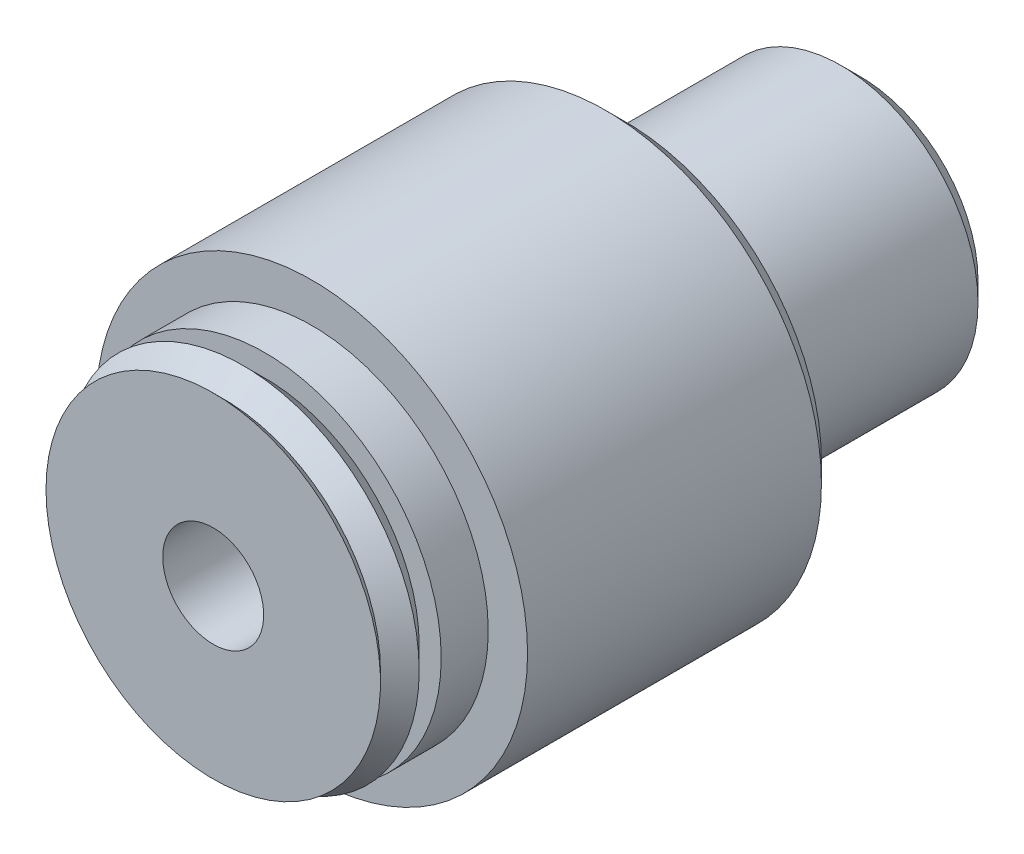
ISO-10303-21;
HEADER;
FILE_DESCRIPTION(('STEP AP214'),'2;1');
FILE_NAME('part.step','',(''),(''),'','','');
FILE_SCHEMA(('AUTOMOTIVE_DESIGN { 1 0 10303 214 1 1 1 1 }'));
ENDSEC;
DATA;
#1=APPLICATION_CONTEXT('core data for automotive mechanical design processes');
#2=APPLICATION_PROTOCOL_DEFINITION('international standard','automotive_design',2000,#1);
#3=PRODUCT_CONTEXT('',#1,'mechanical');
#4=PRODUCT('Part','Part','',(#3));
#5=PRODUCT_RELATED_PRODUCT_CATEGORY('part','',(#4));
#6=PRODUCT_DEFINITION_FORMATION('','',#4);
#7=PRODUCT_DEFINITION_CONTEXT('part definition',#1,'design');
#8=PRODUCT_DEFINITION('design','',#6,#7);
#9=PRODUCT_DEFINITION_SHAPE('','',#8);
#10=(LENGTH_UNIT() NAMED_UNIT(*) SI_UNIT(.MILLI.,.METRE.));
#11=(NAMED_UNIT(*) PLANE_ANGLE_UNIT() SI_UNIT($,.RADIAN.));
#12=(NAMED_UNIT(*) SI_UNIT($,.STERADIAN.) SOLID_ANGLE_UNIT());
#13=UNCERTAINTY_MEASURE_WITH_UNIT(LENGTH_MEASURE(1.E-05),#10,'distance_accuracy_value','');
#14=(GEOMETRIC_REPRESENTATION_CONTEXT(3) GLOBAL_UNCERTAINTY_ASSIGNED_CONTEXT((#13)) GLOBAL_UNIT_ASSIGNED_CONTEXT((#10,
#11,#12)) REPRESENTATION_CONTEXT('',''));
#15=CARTESIAN_POINT('',(0.,0.,0.));
#16=DIRECTION('',(0.,0.,1.));
#17=DIRECTION('',(1.,0.,0.));
#18=AXIS2_PLACEMENT_3D('',#15,#16,#17);
#19=CARTESIAN_POINT('',(0.,0.,0.));
#20=DIRECTION('',(0.,0.,1.));
#21=DIRECTION('',(1.,0.,0.));
#22=AXIS2_PLACEMENT_3D('',#19,#20,#21);
#23=PLANE('',#22);
#24=CARTESIAN_POINT('',(0.,0.,0.));
#25=DIRECTION('',(0.,0.,-1.));
#26=DIRECTION('',(-1.,0.,0.));
#27=AXIS2_PLACEMENT_3D('',#24,#25,#26);
#28=CIRCLE('',#27,6.77545);
#29=CARTESIAN_POINT('',(-6.77545000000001,0.,0.));
#30=VERTEX_POINT('',#29);
#31=EDGE_CURVE('E117',#30,#30,#28,.T.);
#32=ORIENTED_EDGE('',*,*,#31,.F.);
#33=EDGE_LOOP('',(#32));
#34=FACE_BOUND('',#33,.T.);
#35=CARTESIAN_POINT('',(0.,0.,0.));
#36=DIRECTION('',(0.,0.,-1.));
#37=DIRECTION('',(-1.,0.,0.));
#38=AXIS2_PLACEMENT_3D('',#35,#36,#37);
#39=CIRCLE('',#38,2.0447);
#40=CARTESIAN_POINT('',(-2.0447,0.,0.));
#41=VERTEX_POINT('',#40);
#42=EDGE_CURVE('E128',#41,#41,#39,.T.);
#43=ORIENTED_EDGE('',*,*,#42,.T.);
#44=EDGE_LOOP('',(#43));
#45=FACE_BOUND('',#44,.T.);
#46=ADVANCED_FACE('F32',(#34,#45),#23,.T.);
#47=CARTESIAN_POINT('',(0.,0.,-26.223214));
#48=DIRECTION('',(0.,0.,-1.));
#49=DIRECTION('',(-1.,0.,0.));
#50=AXIS2_PLACEMENT_3D('',#47,#48,#49);
#51=PLANE('',#50);
#52=CARTESIAN_POINT('',(0.,0.,-26.223214));
#53=DIRECTION('',(0.,0.,-1.));
#54=DIRECTION('',(-1.,0.,0.));
#55=AXIS2_PLACEMENT_3D('',#52,#53,#54);
#56=CIRCLE('',#55,4.7625);
#57=CARTESIAN_POINT('',(4.76250000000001,0.,-26.223214));
#58=VERTEX_POINT('',#57);
#59=EDGE_CURVE('E49',#58,#58,#56,.T.);
#60=ORIENTED_EDGE('',*,*,#59,.T.);
#61=EDGE_LOOP('',(#60));
#62=FACE_BOUND('',#61,.T.);
#63=CARTESIAN_POINT('',(0.,0.,-26.223214));
#64=DIRECTION('',(0.,0.,-1.));
#65=DIRECTION('',(-1.,0.,0.));
#66=AXIS2_PLACEMENT_3D('',#63,#64,#65);
#67=CIRCLE('',#66,2.0447);
#68=CARTESIAN_POINT('',(-2.0447,0.,-26.223214));
#69=VERTEX_POINT('',#68);
#70=EDGE_CURVE('E126',#69,#69,#67,.T.);
#71=ORIENTED_EDGE('',*,*,#70,.F.);
#72=EDGE_LOOP('',(#71));
#73=FACE_BOUND('',#72,.T.);
#74=ADVANCED_FACE('F65',(#62,#73),#51,.T.);
#75=CARTESIAN_POINT('',(-8.73760000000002,0.,-7.173214));
#76=DIRECTION('',(1.,0.,0.));
#77=DIRECTION('',(0.,0.,-1.));
#78=AXIS2_PLACEMENT_3D('',#75,#76,#77);
#79=CYLINDRICAL_SURFACE('',#78,2.032);
#80=CARTESIAN_POINT('',(-8.73760000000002,0.,-9.205214));
#81=CARTESIAN_POINT('',(-8.73759797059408,-0.112516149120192,-9.20521042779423));
#82=CARTESIAN_POINT('',(-8.73540475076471,-0.225074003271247,-9.1958371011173));
#83=CARTESIAN_POINT('',(-8.72686767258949,-0.44698022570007,-9.15863769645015));
#84=CARTESIAN_POINT('',(-8.72052111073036,-0.556326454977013,-9.13079959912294));
#85=CARTESIAN_POINT('',(-8.70438234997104,-0.768571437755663,-9.05759945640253));
#86=CARTESIAN_POINT('',(-8.6945939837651,-0.871477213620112,-9.0122568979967));
#87=CARTESIAN_POINT('',(-8.67262205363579,-1.06821919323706,-8.90539972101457));
#88=CARTESIAN_POINT('',(-8.6604384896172,-1.16205539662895,-8.84388510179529));
#89=CARTESIAN_POINT('',(-8.63476052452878,-1.33968569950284,-8.7052590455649));
#90=CARTESIAN_POINT('',(-8.62124813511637,-1.42329320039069,-8.62791182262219));
#91=CARTESIAN_POINT('',(-8.59455904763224,-1.57647313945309,-8.46032176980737));
#92=CARTESIAN_POINT('',(-8.58138238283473,-1.64604419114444,-8.37007766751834));
#93=CARTESIAN_POINT('',(-8.55667768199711,-1.77002273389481,-8.17784635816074));
#94=CARTESIAN_POINT('',(-8.54517260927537,-1.82422727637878,-8.07572504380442));
#95=CARTESIAN_POINT('',(-8.52537378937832,-1.91463093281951,-7.8635103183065));
#96=CARTESIAN_POINT('',(-8.51707960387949,-1.9508325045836,-7.75341799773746));
#97=CARTESIAN_POINT('',(-8.5048256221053,-2.00357737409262,-7.53042272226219));
#98=CARTESIAN_POINT('',(-8.50079258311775,-2.02045329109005,-7.4176025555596));
#99=CARTESIAN_POINT('',(-8.4972978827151,-2.03510284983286,-7.19066583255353));
#100=CARTESIAN_POINT('',(-8.4978355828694,-2.03287915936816,-7.07654945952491));
#101=CARTESIAN_POINT('',(-8.50335549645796,-2.00965931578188,-6.85276454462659));
#102=CARTESIAN_POINT('',(-8.50824523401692,-1.9890537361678,-6.74305284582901));
#103=CARTESIAN_POINT('',(-8.52177157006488,-1.93027563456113,-6.52868762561));
#104=CARTESIAN_POINT('',(-8.5304084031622,-1.89210201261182,-6.42403442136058));
#105=CARTESIAN_POINT('',(-8.55054421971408,-1.7989239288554,-6.22168063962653));
#106=CARTESIAN_POINT('',(-8.56206795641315,-1.7437729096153,-6.12405011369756));
#107=CARTESIAN_POINT('',(-8.5866644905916,-1.61830836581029,-5.93928667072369));
#108=CARTESIAN_POINT('',(-8.59973752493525,-1.54799252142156,-5.85215536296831));
#109=CARTESIAN_POINT('',(-8.62635329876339,-1.39214573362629,-5.68861933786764));
#110=CARTESIAN_POINT('',(-8.63989969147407,-1.30628371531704,-5.61253037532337));
#111=CARTESIAN_POINT('',(-8.66564488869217,-1.12286054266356,-5.47577636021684));
#112=CARTESIAN_POINT('',(-8.67784366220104,-1.02529911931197,-5.41511166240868));
#113=CARTESIAN_POINT('',(-8.69956723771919,-0.82083344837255,-5.31083423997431));
#114=CARTESIAN_POINT('',(-8.70908487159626,-0.713905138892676,-5.26726710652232));
#115=CARTESIAN_POINT('',(-8.72432110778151,-0.493973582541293,-5.19880975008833));
#116=CARTESIAN_POINT('',(-8.73004033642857,-0.3809713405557,-5.17391644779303));
#117=CARTESIAN_POINT('',(-8.73694469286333,-0.154804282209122,-5.14398241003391));
#118=CARTESIAN_POINT('',(-8.73822817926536,-0.0416993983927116,-5.13851093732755));
#119=CARTESIAN_POINT('',(-8.73639399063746,0.183808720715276,-5.14640245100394));
#120=CARTESIAN_POINT('',(-8.73327665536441,0.296212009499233,-5.15976398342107));
#121=CARTESIAN_POINT('',(-8.72305358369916,0.515669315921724,-5.20458583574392));
#122=CARTESIAN_POINT('',(-8.71599851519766,0.622772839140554,-5.235816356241));
#123=CARTESIAN_POINT('',(-8.69869154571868,0.830218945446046,-5.31523144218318));
#124=CARTESIAN_POINT('',(-8.68843934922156,0.930560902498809,-5.36341757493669));
#125=CARTESIAN_POINT('',(-8.66563542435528,1.12338808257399,-5.47624658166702));
#126=CARTESIAN_POINT('',(-8.65304991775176,1.21572409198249,-5.54113748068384));
#127=CARTESIAN_POINT('',(-8.62703722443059,1.3883502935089,-5.68521157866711));
#128=CARTESIAN_POINT('',(-8.61360991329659,1.46863869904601,-5.76439689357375));
#129=CARTESIAN_POINT('',(-8.58708097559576,1.61662481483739,-5.93679944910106));
#130=CARTESIAN_POINT('',(-8.57399212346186,1.68402246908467,-6.03027660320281));
#131=CARTESIAN_POINT('',(-8.54994125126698,1.8021675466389,-6.22747354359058));
#132=CARTESIAN_POINT('',(-8.53897913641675,1.85291571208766,-6.33119287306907));
#133=CARTESIAN_POINT('',(-8.52053551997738,1.93595940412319,-6.54536375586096));
#134=CARTESIAN_POINT('',(-8.51303376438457,1.96836256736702,-6.6557717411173));
#135=CARTESIAN_POINT('',(-8.5023300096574,2.01410032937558,-6.88066534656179));
#136=CARTESIAN_POINT('',(-8.49912721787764,2.02743844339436,-6.99515021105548));
#137=CARTESIAN_POINT('',(-8.49743852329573,2.03450298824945,-7.22191105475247));
#138=CARTESIAN_POINT('',(-8.49883782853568,2.02870668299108,-7.33417156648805));
#139=CARTESIAN_POINT('',(-8.50593357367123,1.99874469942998,-7.55606831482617));
#140=CARTESIAN_POINT('',(-8.5116299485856,1.97457929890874,-7.66570459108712));
#141=CARTESIAN_POINT('',(-8.52661852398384,1.90880893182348,-7.87880189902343));
#142=CARTESIAN_POINT('',(-8.53589461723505,1.86728201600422,-7.98228822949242));
#143=CARTESIAN_POINT('',(-8.55700187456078,1.76803152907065,-8.18089276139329));
#144=CARTESIAN_POINT('',(-8.56883334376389,1.71030602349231,-8.27600996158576));
#145=CARTESIAN_POINT('',(-8.59405451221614,1.5787511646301,-8.45750939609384));
#146=CARTESIAN_POINT('',(-8.60747352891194,1.50458544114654,-8.54364379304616));
#147=CARTESIAN_POINT('',(-8.63417061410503,1.3429261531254,-8.70240034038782));
#148=CARTESIAN_POINT('',(-8.64744864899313,1.2554294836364,-8.77501933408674));
#149=CARTESIAN_POINT('',(-8.67260607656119,1.06799924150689,-8.90574186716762));
#150=CARTESIAN_POINT('',(-8.68446134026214,0.967897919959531,-8.96360983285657));
#151=CARTESIAN_POINT('',(-8.70519060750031,0.759128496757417,-9.06160543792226));
#152=CARTESIAN_POINT('',(-8.71406695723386,0.650467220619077,-9.10174704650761));
#153=CARTESIAN_POINT('',(-8.72636889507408,0.451515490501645,-9.15650029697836));
#154=CARTESIAN_POINT('',(-8.73055328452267,0.362250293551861,-9.17473116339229));
#155=CARTESIAN_POINT('',(-8.73616958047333,0.181999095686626,-9.19908911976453));
#156=CARTESIAN_POINT('',(-8.73760164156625,0.0910131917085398,-9.20521688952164));
#157=CARTESIAN_POINT('',(-8.73760000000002,0.,-9.205214));
#158=B_SPLINE_CURVE_WITH_KNOTS('',3,(#80,#81,#82,#83,#84,#85,#86,#87,#88,#89,#90,#91,#92,#93,
#94,#95,#96,#97,#98,#99,#100,#101,#102,#103,#104,#105,#106,#107,#108,#109,#110,#111,#112,#113,
#114,#115,#116,#117,#118,#119,#120,#121,#122,#123,#124,#125,#126,#127,#128,#129,#130,#131,#132,
#133,#134,#135,#136,#137,#138,#139,#140,#141,#142,#143,#144,#145,#146,#147,#148,#149,#150,#151,
#152,#153,#154,#155,#156,#157),.UNSPECIFIED.,.T.,.F.,(4,2,2,2,2,2,2,2,2,2,2,2,2,2,2,2,2,2,2,2,2,
2,2,2,2,2,2,2,2,2,2,2,2,2,2,2,2,2,4),(0.,0.337215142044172,0.674650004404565,1.01171029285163,
1.34877059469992,1.69127297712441,2.0338091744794,2.38067838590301,2.72750022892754,
3.06825860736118,3.40896939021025,3.74260884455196,4.07626919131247,4.41289470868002,
4.74957175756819,5.0945120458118,5.4394602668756,5.78532215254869,6.13112699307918,
6.46921292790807,6.807272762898,7.14107976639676,7.47491763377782,7.81403098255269,
8.15319457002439,8.49948578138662,8.8457615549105,9.18998397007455,9.53414290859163,
9.86978309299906,10.205418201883,10.5395603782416,10.8737424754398,11.2155243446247,
11.5573859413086,11.9044062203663,12.2511525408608,12.5239378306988,12.7967077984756),.UNSPECIFIED.);
#159=CARTESIAN_POINT('',(-8.73760000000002,0.,-9.205214));
#160=VERTEX_POINT('',#159);
#161=EDGE_CURVE('E10',#160,#160,#158,.T.);
#162=ORIENTED_EDGE('',*,*,#161,.T.);
#163=EDGE_LOOP('',(#162));
#164=FACE_BOUND('',#163,.T.);
#165=CARTESIAN_POINT('',(-2.0447,0.,-9.205214));
#166=CARTESIAN_POINT('',(-2.04469164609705,-0.0907692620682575,-9.205205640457));
#167=CARTESIAN_POINT('',(-2.03859838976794,-0.181645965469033,-9.19907461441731));
#168=CARTESIAN_POINT('',(-2.0147296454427,-0.360317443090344,-9.17505394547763));
#169=CARTESIAN_POINT('',(-1.99693239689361,-0.448106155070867,-9.15714239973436));
#170=CARTESIAN_POINT('',(-1.95121165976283,-0.617422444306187,-9.11111490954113));
#171=CARTESIAN_POINT('',(-1.92335962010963,-0.698989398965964,-9.08307096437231));
#172=CARTESIAN_POINT('',(-1.85924960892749,-0.855056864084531,-9.01849168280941));
#173=CARTESIAN_POINT('',(-1.82299006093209,-0.929556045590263,-8.98195475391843));
#174=CARTESIAN_POINT('',(-1.72749468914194,-1.0998149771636,-8.88567349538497));
#175=CARTESIAN_POINT('',(-1.66492910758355,-1.19179610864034,-8.82255127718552));
#176=CARTESIAN_POINT('',(-1.53032027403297,-1.36037434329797,-8.68655315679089));
#177=CARTESIAN_POINT('',(-1.45825327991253,-1.43693165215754,-8.61365281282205));
#178=CARTESIAN_POINT('',(-1.2785281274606,-1.60194349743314,-8.43146298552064));
#179=CARTESIAN_POINT('',(-1.16785610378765,-1.6836151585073,-8.31897588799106));
#180=CARTESIAN_POINT('',(-0.997048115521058,-1.78636860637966,-8.14402795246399));
#181=CARTESIAN_POINT('',(-0.939300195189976,-1.81733159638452,-8.08466336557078));
#182=CARTESIAN_POINT('',(-0.822756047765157,-1.87297329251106,-7.96404129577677));
#183=CARTESIAN_POINT('',(-0.763960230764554,-1.89765440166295,-7.90278454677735));
#184=CARTESIAN_POINT('',(-0.666830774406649,-1.93333877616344,-7.80015437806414));
#185=CARTESIAN_POINT('',(-0.628543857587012,-1.94610480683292,-7.75933240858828));
#186=CARTESIAN_POINT('',(-0.552277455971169,-1.96910315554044,-7.6767022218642));
#187=CARTESIAN_POINT('',(-0.514297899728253,-1.97933607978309,-7.63489424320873));
#188=CARTESIAN_POINT('',(-0.451579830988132,-1.99438063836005,-7.56351457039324));
#189=CARTESIAN_POINT('',(-0.426530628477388,-1.99987535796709,-7.53435730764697));
#190=CARTESIAN_POINT('',(-0.377530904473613,-2.00969786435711,-7.4749572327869));
#191=CARTESIAN_POINT('',(-0.353579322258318,-2.01402679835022,-7.4447155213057));
#192=CARTESIAN_POINT('',(-0.316963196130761,-2.02003325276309,-7.39426165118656));
#193=CARTESIAN_POINT('',(-0.303505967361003,-2.02208966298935,-7.37467551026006));
#194=CARTESIAN_POINT('',(-0.278341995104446,-2.02570545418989,-7.33431377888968));
#195=CARTESIAN_POINT('',(-0.266634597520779,-2.02726502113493,-7.31353863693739));
#196=CARTESIAN_POINT('',(-0.250229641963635,-2.0293413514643,-7.27804646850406));
#197=CARTESIAN_POINT('',(-0.244522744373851,-2.03003157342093,-7.26382143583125));
#198=CARTESIAN_POINT('',(-0.235295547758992,-2.03112180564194,-7.23468956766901));
#199=CARTESIAN_POINT('',(-0.23176681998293,-2.0315229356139,-7.21978560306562));
#200=CARTESIAN_POINT('',(-0.227607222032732,-2.03199375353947,-7.18931711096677));
#201=CARTESIAN_POINT('',(-0.227019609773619,-2.03205849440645,-7.17374610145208));
#202=CARTESIAN_POINT('',(-0.229037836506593,-2.03183175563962,-7.14281489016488));
#203=CARTESIAN_POINT('',(-0.231647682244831,-2.03153982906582,-7.12745497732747));
#204=CARTESIAN_POINT('',(-0.240546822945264,-2.03050709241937,-7.09290859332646));
#205=CARTESIAN_POINT('',(-0.247708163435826,-2.02965748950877,-7.07396449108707));
#206=CARTESIAN_POINT('',(-0.264574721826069,-2.02752855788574,-7.0372244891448));
#207=CARTESIAN_POINT('',(-0.274295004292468,-2.02624667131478,-7.01943619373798));
#208=CARTESIAN_POINT('',(-0.305896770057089,-2.02179960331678,-6.96678323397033));
#209=CARTESIAN_POINT('',(-0.329948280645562,-2.01805880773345,-6.93331022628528));
#210=CARTESIAN_POINT('',(-0.380090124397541,-2.00922786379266,-6.86808749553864));
#211=CARTESIAN_POINT('',(-0.406186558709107,-2.00413356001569,-6.83634344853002));
#212=CARTESIAN_POINT('',(-0.459409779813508,-1.99260702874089,-6.77376894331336));
#213=CARTESIAN_POINT('',(-0.486539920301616,-1.9861700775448,-6.74294216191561));
#214=CARTESIAN_POINT('',(-0.541174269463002,-1.97198554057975,-6.68201955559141));
#215=CARTESIAN_POINT('',(-0.568677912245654,-1.964239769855,-6.65192278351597));
#216=CARTESIAN_POINT('',(-0.651279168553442,-1.93905552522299,-6.56254259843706));
#217=CARTESIAN_POINT('',(-0.706605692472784,-1.91964085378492,-6.50401254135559));
#218=CARTESIAN_POINT('',(-0.816833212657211,-1.87539884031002,-6.38853454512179));
#219=CARTESIAN_POINT('',(-0.871733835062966,-1.85056720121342,-6.33158790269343));
#220=CARTESIAN_POINT('',(-0.980363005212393,-1.79537981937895,-6.21952220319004));
#221=CARTESIAN_POINT('',(-1.0340938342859,-1.76503615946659,-6.16439945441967));
#222=CARTESIAN_POINT('',(-1.13993808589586,-1.69860030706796,-6.05615968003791));
#223=CARTESIAN_POINT('',(-1.19205215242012,-1.6625104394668,-6.00304185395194));
#224=CARTESIAN_POINT('',(-1.32495666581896,-1.5607437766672,-5.86785142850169));
#225=CARTESIAN_POINT('',(-1.40410071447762,-1.49034422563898,-5.78762203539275));
#226=CARTESIAN_POINT('',(-1.55410554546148,-1.33316566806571,-5.63581299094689));
#227=CARTESIAN_POINT('',(-1.62497393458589,-1.24640189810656,-5.56422539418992));
#228=CARTESIAN_POINT('',(-1.73989659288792,-1.0777161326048,-5.44824676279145));
#229=CARTESIAN_POINT('',(-1.78638409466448,-0.999177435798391,-5.40137272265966));
#230=CARTESIAN_POINT('',(-1.86987664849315,-0.832474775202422,-5.31722586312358));
#231=CARTESIAN_POINT('',(-1.90689451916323,-0.744324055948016,-5.27994006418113));
#232=CARTESIAN_POINT('',(-1.96392374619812,-0.574845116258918,-5.22251368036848));
#233=CARTESIAN_POINT('',(-1.98572072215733,-0.494734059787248,-5.20057201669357));
#234=CARTESIAN_POINT('',(-2.01955950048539,-0.330446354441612,-5.16651265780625));
#235=CARTESIAN_POINT('',(-2.0316070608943,-0.246272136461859,-5.1543891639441));
#236=CARTESIAN_POINT('',(-2.04508011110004,-0.0759298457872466,-5.14083136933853));
#237=CARTESIAN_POINT('',(-2.04647124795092,0.010243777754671,-5.13943163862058));
#238=CARTESIAN_POINT('',(-2.03842810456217,0.181562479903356,-5.14752516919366));
#239=CARTESIAN_POINT('',(-2.028992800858,0.266707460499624,-5.15701946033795));
#240=CARTESIAN_POINT('',(-2.00073665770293,0.429344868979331,-5.18545759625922));
#241=CARTESIAN_POINT('',(-1.98239505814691,0.507008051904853,-5.20391894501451));
#242=CARTESIAN_POINT('',(-1.93769587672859,0.657500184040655,-5.24892245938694));
#243=CARTESIAN_POINT('',(-1.91133501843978,0.730327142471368,-5.27546792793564));
#244=CARTESIAN_POINT('',(-1.84043142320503,0.897028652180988,-5.3468954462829));
#245=CARTESIAN_POINT('',(-1.79279370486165,0.988250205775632,-5.39490466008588));
#246=CARTESIAN_POINT('',(-1.68780273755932,1.15852433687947,-5.50080526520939));
#247=CARTESIAN_POINT('',(-1.63043104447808,1.23755325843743,-5.558715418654));
#248=CARTESIAN_POINT('',(-1.4858710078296,1.41067289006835,-5.70481508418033));
#249=CARTESIAN_POINT('',(-1.39553561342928,1.49941185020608,-5.79624928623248));
#250=CARTESIAN_POINT('',(-1.25385453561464,1.61629618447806,-5.94015061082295));
#251=CARTESIAN_POINT('',(-1.2055230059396,1.65259455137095,-5.98931919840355));
#252=CARTESIAN_POINT('',(-1.10722818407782,1.71999707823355,-6.0895723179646));
#253=CARTESIAN_POINT('',(-1.05726510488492,1.75110191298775,-6.14065659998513));
#254=CARTESIAN_POINT('',(-0.954501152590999,1.80923413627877,-6.24615226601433));
#255=CARTESIAN_POINT('',(-0.901661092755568,1.83609242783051,-6.30061780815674));
#256=CARTESIAN_POINT('',(-0.795209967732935,1.88463612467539,-6.4111007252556));
#257=CARTESIAN_POINT('',(-0.741598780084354,1.90632069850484,-6.4671183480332));
#258=CARTESIAN_POINT('',(-0.634540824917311,1.94457946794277,-6.58059335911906));
#259=CARTESIAN_POINT('',(-0.581094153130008,1.9611716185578,-6.63804489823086));
#260=CARTESIAN_POINT('',(-0.475184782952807,1.98945708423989,-6.75516283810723));
#261=CARTESIAN_POINT('',(-0.422722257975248,2.00114954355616,-6.81482962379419));
#262=CARTESIAN_POINT('',(-0.355814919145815,2.0135841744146,-6.89936999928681));
#263=CARTESIAN_POINT('',(-0.338716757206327,2.01651901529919,-6.92180212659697));
#264=CARTESIAN_POINT('',(-0.306079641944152,2.02172689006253,-6.9678261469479));
#265=CARTESIAN_POINT('',(-0.290537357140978,2.0240013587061,-6.99141539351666));
#266=CARTESIAN_POINT('',(-0.267886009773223,2.02709498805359,-7.03128186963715));
#267=CARTESIAN_POINT('',(-0.259802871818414,2.0281398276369,-7.04697503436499));
#268=CARTESIAN_POINT('',(-0.24573137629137,2.02989263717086,-7.07929729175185));
#269=CARTESIAN_POINT('',(-0.239737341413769,2.03060152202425,-7.09592370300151));
#270=CARTESIAN_POINT('',(-0.232045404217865,2.03149326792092,-7.12601057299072));
#271=CARTESIAN_POINT('',(-0.229665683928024,2.03176102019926,-7.13928645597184));
#272=CARTESIAN_POINT('',(-0.227264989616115,2.03203113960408,-7.16604063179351));
#273=CARTESIAN_POINT('',(-0.227239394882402,2.03203402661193,-7.17951847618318));
#274=CARTESIAN_POINT('',(-0.22953392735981,2.03177582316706,-7.20622240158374));
#275=CARTESIAN_POINT('',(-0.231848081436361,2.03151540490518,-7.21944903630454));
#276=CARTESIAN_POINT('',(-0.238391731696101,2.03075820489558,-7.24542354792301));
#277=CARTESIAN_POINT('',(-0.242625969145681,2.03026083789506,-7.25817015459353));
#278=CARTESIAN_POINT('',(-0.260818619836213,2.02803852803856,-7.30452899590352));
#279=CARTESIAN_POINT('',(-0.278985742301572,2.02567259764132,-7.33636660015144));
#280=CARTESIAN_POINT('',(-0.318832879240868,2.01979469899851,-7.39773442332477));
#281=CARTESIAN_POINT('',(-0.340547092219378,2.01627119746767,-7.4272375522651));
#282=CARTESIAN_POINT('',(-0.388470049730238,2.00762429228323,-7.48872929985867));
#283=CARTESIAN_POINT('',(-0.414894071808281,2.00235128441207,-7.52053343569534));
#284=CARTESIAN_POINT('',(-0.468594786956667,1.99047225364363,-7.58316346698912));
#285=CARTESIAN_POINT('',(-0.495872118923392,1.98386521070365,-7.61398859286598));
#286=CARTESIAN_POINT('',(-0.578335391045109,1.96202781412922,-7.70558960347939));
#287=CARTESIAN_POINT('',(-0.634078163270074,1.94479403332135,-7.76540257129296));
#288=CARTESIAN_POINT('',(-0.745295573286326,1.90494886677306,-7.88316815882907));
#289=CARTESIAN_POINT('',(-0.800770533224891,1.8823501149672,-7.94112479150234));
#290=CARTESIAN_POINT('',(-0.910856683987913,1.83161335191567,-8.05532483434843));
#291=CARTESIAN_POINT('',(-0.965468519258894,1.80347970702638,-8.11156955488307));
#292=CARTESIAN_POINT('',(-1.07361910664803,1.74127897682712,-8.22251584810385));
#293=CARTESIAN_POINT('',(-1.12715011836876,1.70717948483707,-8.27720699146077));
#294=CARTESIAN_POINT('',(-1.2322522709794,1.63294218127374,-8.38431998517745));
#295=CARTESIAN_POINT('',(-1.28382266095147,1.59280208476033,-8.43674096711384));
#296=CARTESIAN_POINT('',(-1.43451109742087,1.46304371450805,-8.58967235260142));
#297=CARTESIAN_POINT('',(-1.5299652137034,1.36388904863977,-8.6862174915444));
#298=CARTESIAN_POINT('',(-1.67162329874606,1.18087120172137,-8.82929545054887));
#299=CARTESIAN_POINT('',(-1.7229487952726,1.10501466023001,-8.8810823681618));
#300=CARTESIAN_POINT('',(-1.81674916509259,0.942845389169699,-8.97566830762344));
#301=CARTESIAN_POINT('',(-1.85923381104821,0.856544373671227,-9.01847725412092));
#302=CARTESIAN_POINT('',(-1.92695599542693,0.688833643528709,-9.08669222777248));
#303=CARTESIAN_POINT('',(-1.9538537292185,0.608780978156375,-9.11377491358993));
#304=CARTESIAN_POINT('',(-1.9978473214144,0.443479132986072,-9.15806323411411));
#305=CARTESIAN_POINT('',(-2.01496423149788,0.358241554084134,-9.17529008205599));
#306=CARTESIAN_POINT('',(-2.03258082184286,0.226854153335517,-9.19301871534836));
#307=CARTESIAN_POINT('',(-2.03711348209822,0.181737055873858,-9.19757991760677));
#308=CARTESIAN_POINT('',(-2.04317551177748,0.0910890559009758,-9.20368000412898));
#309=CARTESIAN_POINT('',(-2.04470419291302,0.045558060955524,-9.20521819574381));
#310=CARTESIAN_POINT('',(-2.0447,0.,-9.205214));
#311=B_SPLINE_CURVE_WITH_KNOTS('',3,(#165,#166,#167,#168,#169,#170,#171,#172,#173,#174,#175,
#176,#177,#178,#179,#180,#181,#182,#183,#184,#185,#186,#187,#188,#189,#190,#191,#192,#193,#194,
#195,#196,#197,#198,#199,#200,#201,#202,#203,#204,#205,#206,#207,#208,#209,#210,#211,#212,#213,
#214,#215,#216,#217,#218,#219,#220,#221,#222,#223,#224,#225,#226,#227,#228,#229,#230,#231,#232,
#233,#234,#235,#236,#237,#238,#239,#240,#241,#242,#243,#244,#245,#246,#247,#248,#249,#250,#251,
#252,#253,#254,#255,#256,#257,#258,#259,#260,#261,#262,#263,#264,#265,#266,#267,#268,#269,#270,
#271,#272,#273,#274,#275,#276,#277,#278,#279,#280,#281,#282,#283,#284,#285,#286,#287,#288,#289,
#290,#291,#292,#293,#294,#295,#296,#297,#298,#299,#300,#301,#302,#303,#304,#305,#306,#307,#308,
#309,#310),.UNSPECIFIED.,.T.,.F.,(4,2,2,2,2,2,2,2,2,2,2,2,2,2,2,2,2,2,2,2,2,2,2,2,2,2,2,2,2,2,2,
2,2,2,2,2,2,2,2,2,2,2,2,2,2,2,2,2,2,2,2,2,2,2,2,2,2,2,2,2,2,2,2,2,2,2,2,2,2,2,2,2,4),(0.,
0.272102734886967,0.54471281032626,0.815422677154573,1.08618334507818,1.46776623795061,
1.85032137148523,2.38028700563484,2.64537501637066,2.91036146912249,3.08252593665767,
3.25464916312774,3.37111876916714,3.48747333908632,3.55898914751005,3.63047815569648,
3.67638891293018,3.72212087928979,3.76852353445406,3.81498439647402,3.87545171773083,
3.93628329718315,4.06010768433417,4.18431670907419,4.30897032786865,4.43345247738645,
4.6817842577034,4.93031375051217,5.17830487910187,5.42619592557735,5.82348625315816,
6.22040847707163,6.5270969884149,6.833368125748,7.089897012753,7.34627428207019,7.6034776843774,
7.86070540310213,8.10541145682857,8.35021762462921,8.689004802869,9.02844124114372,
9.49429070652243,9.7278961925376,9.9614713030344,10.2027798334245,10.4441271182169,
10.6846134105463,10.9251416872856,11.0101866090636,11.0950453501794,11.1480099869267,
11.2008295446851,11.2411194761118,11.2813303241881,11.3214387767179,11.3616468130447,
11.4709320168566,11.5813408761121,11.7062925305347,11.8313400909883,12.0817835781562,
12.3316430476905,12.5813061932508,12.8323701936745,13.0835294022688,13.5842169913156,
13.8988745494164,14.2131824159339,14.4781758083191,14.7425966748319,14.8791366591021,
15.0157079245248),.UNSPECIFIED.);
#312=CARTESIAN_POINT('',(-2.0447,0.,-9.205214));
#313=VERTEX_POINT('',#312);
#314=EDGE_CURVE('E36',#313,#313,#311,.T.);
#315=ORIENTED_EDGE('',*,*,#314,.F.);
#316=EDGE_LOOP('',(#315));
#317=FACE_BOUND('',#316,.T.);
#318=ADVANCED_FACE('F60',(#164,#317),#79,.F.);
#319=CARTESIAN_POINT('',(0.,0.,-16.698214));
#320=DIRECTION('',(0.,0.,1.));
#321=DIRECTION('',(1.,0.,0.));
#322=AXIS2_PLACEMENT_3D('',#319,#320,#321);
#323=PLANE('',#322);
#324=CARTESIAN_POINT('',(0.,0.,-16.698214));
#325=DIRECTION('',(0.,0.,1.));
#326=DIRECTION('',(1.,0.,0.));
#327=AXIS2_PLACEMENT_3D('',#324,#325,#326);
#328=CIRCLE('',#327,7.94385);
#329=CARTESIAN_POINT('',(7.94385000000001,0.,-16.698214));
#330=VERTEX_POINT('',#329);
#331=EDGE_CURVE('E108',#330,#330,#328,.F.);
#332=ORIENTED_EDGE('',*,*,#331,.T.);
#333=EDGE_LOOP('',(#332));
#334=FACE_BOUND('',#333,.T.);
#335=CARTESIAN_POINT('',(0.,0.,-16.698214));
#336=DIRECTION('',(0.,0.,1.));
#337=DIRECTION('',(1.,0.,0.));
#338=AXIS2_PLACEMENT_3D('',#335,#336,#337);
#339=CIRCLE('',#338,5.55625);
#340=CARTESIAN_POINT('',(5.55625000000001,0.,-16.698214));
#341=VERTEX_POINT('',#340);
#342=EDGE_CURVE('E113',#341,#341,#339,.F.);
#343=ORIENTED_EDGE('',*,*,#342,.F.);
#344=EDGE_LOOP('',(#343));
#345=FACE_BOUND('',#344,.T.);
#346=ADVANCED_FACE('F64',(#334,#345),#323,.F.);
#347=CARTESIAN_POINT('',(0.,0.,-0.416559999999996));
#348=DIRECTION('',(0.,0.,1.));
#349=DIRECTION('',(1.,0.,0.));
#350=AXIS2_PLACEMENT_3D('',#347,#348,#349);
#351=CONICAL_SURFACE('',#350,6.35889,0.785398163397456);
#352=ORIENTED_EDGE('',*,*,#31,.T.);
#353=EDGE_LOOP('',(#352));
#354=FACE_BOUND('',#353,.T.);
#355=CARTESIAN_POINT('',(0.,0.,-0.416559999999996));
#356=DIRECTION('',(0.,0.,-1.));
#357=DIRECTION('',(-1.,0.,0.));
#358=AXIS2_PLACEMENT_3D('',#355,#356,#357);
#359=CIRCLE('',#358,6.35889);
#360=CARTESIAN_POINT('',(-6.35889000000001,0.,-0.416559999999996));
#361=VERTEX_POINT('',#360);
#362=EDGE_CURVE('E148',#361,#361,#359,.T.);
#363=ORIENTED_EDGE('',*,*,#362,.F.);
#364=EDGE_LOOP('',(#363));
#365=FACE_BOUND('',#364,.T.);
#366=ADVANCED_FACE('F79',(#354,#365),#351,.T.);
#367=CARTESIAN_POINT('',(0.,0.,-1.20141999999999));
#368=DIRECTION('',(0.,0.,-1.));
#369=DIRECTION('',(-1.,0.,0.));
#370=AXIS2_PLACEMENT_3D('',#367,#368,#369);
#371=CONICAL_SURFACE('',#370,7.14374999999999,0.785398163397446);
#372=ORIENTED_EDGE('',*,*,#362,.T.);
#373=EDGE_LOOP('',(#372));
#374=FACE_BOUND('',#373,.T.);
#375=CARTESIAN_POINT('',(0.,0.,-1.20141999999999));
#376=DIRECTION('',(0.,0.,-1.));
#377=DIRECTION('',(-1.,0.,0.));
#378=AXIS2_PLACEMENT_3D('',#375,#376,#377);
#379=CIRCLE('',#378,7.14374999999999);
#380=CARTESIAN_POINT('',(-7.14375000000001,0.,-1.20141999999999));
#381=VERTEX_POINT('',#380);
#382=EDGE_CURVE('E145',#381,#381,#379,.T.);
#383=ORIENTED_EDGE('',*,*,#382,.F.);
#384=EDGE_LOOP('',(#383));
#385=FACE_BOUND('',#384,.T.);
#386=ADVANCED_FACE('F154',(#374,#385),#371,.T.);
#387=CARTESIAN_POINT('',(0.,0.,-2.093214));
#388=DIRECTION('',(0.,0.,1.));
#389=DIRECTION('',(1.,0.,0.));
#390=AXIS2_PLACEMENT_3D('',#387,#388,#389);
#391=CONICAL_SURFACE('',#390,6.25195599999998,0.785398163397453);
#392=ORIENTED_EDGE('',*,*,#382,.T.);
#393=EDGE_LOOP('',(#392));
#394=FACE_BOUND('',#393,.T.);
#395=CARTESIAN_POINT('',(0.,0.,-2.093214));
#396=DIRECTION('',(0.,0.,-1.));
#397=DIRECTION('',(-1.,0.,0.));
#398=AXIS2_PLACEMENT_3D('',#395,#396,#397);
#399=CIRCLE('',#398,6.25195599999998);
#400=CARTESIAN_POINT('',(-6.251956,0.,-2.093214));
#401=VERTEX_POINT('',#400);
#402=EDGE_CURVE('E142',#401,#401,#399,.T.);
#403=ORIENTED_EDGE('',*,*,#402,.F.);
#404=EDGE_LOOP('',(#403));
#405=FACE_BOUND('',#404,.T.);
#406=ADVANCED_FACE('F159',(#394,#405),#391,.T.);
#407=CARTESIAN_POINT('',(0.,6.25195599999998,-2.093214));
#408=DIRECTION('',(0.,0.,1.));
#409=DIRECTION('',(1.,0.,0.));
#410=AXIS2_PLACEMENT_3D('',#407,#408,#409);
#411=PLANE('',#410);
#412=ORIENTED_EDGE('',*,*,#402,.T.);
#413=EDGE_LOOP('',(#412));
#414=FACE_BOUND('',#413,.T.);
#415=CARTESIAN_POINT('',(0.,0.,-2.093214));
#416=DIRECTION('',(0.,0.,-1.));
#417=DIRECTION('',(-1.,0.,0.));
#418=AXIS2_PLACEMENT_3D('',#415,#416,#417);
#419=CIRCLE('',#418,7.14374999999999);
#420=CARTESIAN_POINT('',(-7.14375000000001,0.,-2.093214));
#421=VERTEX_POINT('',#420);
#422=EDGE_CURVE('E139',#421,#421,#419,.T.);
#423=ORIENTED_EDGE('',*,*,#422,.F.);
#424=EDGE_LOOP('',(#423));
#425=FACE_BOUND('',#424,.T.);
#426=ADVANCED_FACE('F164',(#414,#425),#411,.T.);
#427=CARTESIAN_POINT('',(0.,0.,-71.2941240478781));
#428=DIRECTION('',(0.,0.,-1.));
#429=DIRECTION('',(-1.,0.,0.));
#430=AXIS2_PLACEMENT_3D('',#427,#428,#429);
#431=CYLINDRICAL_SURFACE('',#430,7.14374999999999);
#432=ORIENTED_EDGE('',*,*,#422,.T.);
#433=EDGE_LOOP('',(#432));
#434=FACE_BOUND('',#433,.T.);
#435=CARTESIAN_POINT('',(0.,0.,-3.998214));
#436=DIRECTION('',(0.,0.,-1.));
#437=DIRECTION('',(-1.,0.,0.));
#438=AXIS2_PLACEMENT_3D('',#435,#436,#437);
#439=CIRCLE('',#438,7.14374999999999);
#440=CARTESIAN_POINT('',(-7.14375000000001,0.,-3.998214));
#441=VERTEX_POINT('',#440);
#442=EDGE_CURVE('E137',#441,#441,#439,.T.);
#443=ORIENTED_EDGE('',*,*,#442,.F.);
#444=EDGE_LOOP('',(#443));
#445=FACE_BOUND('',#444,.T.);
#446=ADVANCED_FACE('F86',(#434,#445),#431,.T.);
#447=CARTESIAN_POINT('',(0.,0.,-16.698214));
#448=DIRECTION('',(0.,0.,1.));
#449=DIRECTION('',(1.,0.,0.));
#450=AXIS2_PLACEMENT_3D('',#447,#448,#449);
#451=CYLINDRICAL_SURFACE('',#450,8.7376);
#452=ORIENTED_EDGE('',*,*,#161,.F.);
#453=EDGE_LOOP('',(#452));
#454=FACE_BOUND('',#453,.T.);
#455=CARTESIAN_POINT('',(0.,0.,-15.904464));
#456=DIRECTION('',(0.,0.,1.));
#457=DIRECTION('',(1.,0.,0.));
#458=AXIS2_PLACEMENT_3D('',#455,#456,#457);
#459=CIRCLE('',#458,8.7376);
#460=CARTESIAN_POINT('',(8.73760000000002,0.,-15.904464));
#461=VERTEX_POINT('',#460);
#462=EDGE_CURVE('E111',#461,#461,#459,.T.);
#463=ORIENTED_EDGE('',*,*,#462,.T.);
#464=EDGE_LOOP('',(#463));
#465=FACE_BOUND('',#464,.T.);
#466=CARTESIAN_POINT('',(0.,0.,-3.998214));
#467=DIRECTION('',(0.,0.,1.));
#468=DIRECTION('',(1.,0.,0.));
#469=AXIS2_PLACEMENT_3D('',#466,#467,#468);
#470=CIRCLE('',#469,8.7376);
#471=CARTESIAN_POINT('',(8.73760000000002,0.,-3.998214));
#472=VERTEX_POINT('',#471);
#473=EDGE_CURVE('E131',#472,#472,#470,.T.);
#474=ORIENTED_EDGE('',*,*,#473,.F.);
#475=EDGE_LOOP('',(#474));
#476=FACE_BOUND('',#475,.T.);
#477=ADVANCED_FACE('F56',(#454,#465,#476),#451,.T.);
#478=CARTESIAN_POINT('',(0.,0.,-3.998214));
#479=DIRECTION('',(0.,0.,1.));
#480=DIRECTION('',(1.,0.,0.));
#481=AXIS2_PLACEMENT_3D('',#478,#479,#480);
#482=PLANE('',#481);
#483=ORIENTED_EDGE('',*,*,#442,.T.);
#484=EDGE_LOOP('',(#483));
#485=FACE_BOUND('',#484,.T.);
#486=ORIENTED_EDGE('',*,*,#473,.T.);
#487=EDGE_LOOP('',(#486));
#488=FACE_BOUND('',#487,.T.);
#489=ADVANCED_FACE('F76',(#485,#488),#482,.T.);
#490=CARTESIAN_POINT('',(0.,0.,-26.223214));
#491=DIRECTION('',(0.,0.,1.));
#492=DIRECTION('',(1.,0.,0.));
#493=AXIS2_PLACEMENT_3D('',#490,#491,#492);
#494=CYLINDRICAL_SURFACE('',#493,5.55625);
#495=CARTESIAN_POINT('',(0.,0.,-25.429464));
#496=DIRECTION('',(0.,0.,-1.));
#497=DIRECTION('',(-1.,0.,0.));
#498=AXIS2_PLACEMENT_3D('',#495,#496,#497);
#499=CIRCLE('',#498,5.55625);
#500=CARTESIAN_POINT('',(5.55625000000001,0.,-25.429464));
#501=VERTEX_POINT('',#500);
#502=EDGE_CURVE('E45',#501,#501,#499,.F.);
#503=CARTESIAN_POINT('',(5.55625000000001,0.,-25.429464));
#504=CARTESIAN_POINT('',(5.55625000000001,0.,-25.3385134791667));
#505=CARTESIAN_POINT('',(5.55625000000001,0.,-25.2475629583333));
#506=CARTESIAN_POINT('',(5.55625000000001,0.,-25.0656619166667));
#507=CARTESIAN_POINT('',(5.55625000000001,0.,-24.9747113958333));
#508=CARTESIAN_POINT('',(5.55625000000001,0.,-24.7928103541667));
#509=CARTESIAN_POINT('',(5.55625000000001,0.,-24.7018598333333));
#510=CARTESIAN_POINT('',(5.55625000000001,0.,-24.5199587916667));
#511=CARTESIAN_POINT('',(5.55625000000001,0.,-24.4290082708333));
#512=CARTESIAN_POINT('',(5.55625000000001,0.,-24.2471072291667));
#513=CARTESIAN_POINT('',(5.55625000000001,0.,-24.1561567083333));
#514=CARTESIAN_POINT('',(5.55625000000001,0.,-23.9742556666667));
#515=CARTESIAN_POINT('',(5.55625000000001,0.,-23.8833051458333));
#516=CARTESIAN_POINT('',(5.55625000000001,0.,-23.7014041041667));
#517=CARTESIAN_POINT('',(5.55625000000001,0.,-23.6104535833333));
#518=CARTESIAN_POINT('',(5.55625000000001,0.,-23.4285525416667));
#519=CARTESIAN_POINT('',(5.55625000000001,0.,-23.3376020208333));
#520=CARTESIAN_POINT('',(5.55625000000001,0.,-23.1557009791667));
#521=CARTESIAN_POINT('',(5.55625000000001,0.,-23.0647504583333));
#522=CARTESIAN_POINT('',(5.55625000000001,0.,-22.8828494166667));
#523=CARTESIAN_POINT('',(5.55625000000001,0.,-22.7918988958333));
#524=CARTESIAN_POINT('',(5.55625000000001,0.,-22.6099978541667));
#525=CARTESIAN_POINT('',(5.55625000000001,0.,-22.5190473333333));
#526=CARTESIAN_POINT('',(5.55625000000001,0.,-22.3371462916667));
#527=CARTESIAN_POINT('',(5.55625000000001,0.,-22.2461957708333));
#528=CARTESIAN_POINT('',(5.55625000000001,0.,-22.0642947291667));
#529=CARTESIAN_POINT('',(5.55625000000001,0.,-21.9733442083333));
#530=CARTESIAN_POINT('',(5.55625000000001,0.,-21.7914431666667));
#531=CARTESIAN_POINT('',(5.55625000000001,0.,-21.7004926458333));
#532=CARTESIAN_POINT('',(5.55625000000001,0.,-21.5185916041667));
#533=CARTESIAN_POINT('',(5.55625000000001,0.,-21.4276410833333));
#534=CARTESIAN_POINT('',(5.55625000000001,0.,-21.2457400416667));
#535=CARTESIAN_POINT('',(5.55625000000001,0.,-21.1547895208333));
#536=CARTESIAN_POINT('',(5.55625000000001,0.,-20.9728884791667));
#537=CARTESIAN_POINT('',(5.55625000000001,0.,-20.8819379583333));
#538=CARTESIAN_POINT('',(5.55625000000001,0.,-20.7000369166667));
#539=CARTESIAN_POINT('',(5.55625000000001,0.,-20.6090863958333));
#540=CARTESIAN_POINT('',(5.55625000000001,0.,-20.4271853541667));
#541=CARTESIAN_POINT('',(5.55625000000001,0.,-20.3362348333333));
#542=CARTESIAN_POINT('',(5.55625000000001,0.,-20.1543337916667));
#543=CARTESIAN_POINT('',(5.55625000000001,0.,-20.0633832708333));
#544=CARTESIAN_POINT('',(5.55625000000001,0.,-19.8814822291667));
#545=CARTESIAN_POINT('',(5.55625000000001,0.,-19.7905317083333));
#546=CARTESIAN_POINT('',(5.55625000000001,0.,-19.6086306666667));
#547=CARTESIAN_POINT('',(5.55625000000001,0.,-19.5176801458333));
#548=CARTESIAN_POINT('',(5.55625000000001,0.,-19.3357791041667));
#549=CARTESIAN_POINT('',(5.55625000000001,0.,-19.2448285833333));
#550=CARTESIAN_POINT('',(5.55625000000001,0.,-19.0629275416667));
#551=CARTESIAN_POINT('',(5.55625000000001,0.,-18.9719770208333));
#552=CARTESIAN_POINT('',(5.55625000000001,0.,-18.7900759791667));
#553=CARTESIAN_POINT('',(5.55625000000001,0.,-18.6991254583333));
#554=CARTESIAN_POINT('',(5.55625000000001,0.,-18.5172244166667));
#555=CARTESIAN_POINT('',(5.55625000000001,0.,-18.4262738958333));
#556=CARTESIAN_POINT('',(5.55625000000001,0.,-18.2443728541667));
#557=CARTESIAN_POINT('',(5.55625000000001,0.,-18.1534223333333));
#558=CARTESIAN_POINT('',(5.55625000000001,0.,-17.9715212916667));
#559=CARTESIAN_POINT('',(5.55625000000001,0.,-17.8805707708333));
#560=CARTESIAN_POINT('',(5.55625000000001,0.,-17.6986697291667));
#561=CARTESIAN_POINT('',(5.55625000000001,0.,-17.6077192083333));
#562=CARTESIAN_POINT('',(5.55625000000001,0.,-17.4258181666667));
#563=CARTESIAN_POINT('',(5.55625000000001,0.,-17.3348676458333));
#564=CARTESIAN_POINT('',(5.55625000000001,0.,-17.1529666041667));
#565=CARTESIAN_POINT('',(5.55625000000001,0.,-17.0620160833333));
#566=CARTESIAN_POINT('',(5.55625000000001,0.,-16.8801150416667));
#567=CARTESIAN_POINT('',(5.55625000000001,0.,-16.7891645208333));
#568=CARTESIAN_POINT('',(5.55625000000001,0.,-16.698214));
#569=B_SPLINE_CURVE_WITH_KNOTS('',3,(#503,#504,#505,#506,#507,#508,#509,#510,#511,#512,#513,
#514,#515,#516,#517,#518,#519,#520,#521,#522,#523,#524,#525,#526,#527,#528,#529,#530,#531,#532,
#533,#534,#535,#536,#537,#538,#539,#540,#541,#542,#543,#544,#545,#546,#547,#548,#549,#550,#551,
#552,#553,#554,#555,#556,#557,#558,#559,#560,#561,#562,#563,#564,#565,#566,#567,#568),
.UNSPECIFIED.,.F.,.F.,(4,2,2,2,2,2,2,2,2,2,2,2,2,2,2,2,2,2,2,2,2,2,2,2,2,2,2,2,2,2,2,2,4),(0.,
0.272851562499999,0.545703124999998,0.818554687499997,1.09140625,1.3642578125,1.637109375,
1.9099609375,2.1828125,2.4556640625,2.728515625,3.0013671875,3.27421874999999,3.54707031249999,
3.819921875,4.0927734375,4.36562499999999,4.63847656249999,4.91132812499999,5.1841796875,
5.45703124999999,5.72988281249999,6.002734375,6.27558593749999,6.54843749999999,
6.82128906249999,7.09414062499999,7.36699218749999,7.63984374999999,7.91269531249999,
8.18554687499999,8.45839843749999,8.73124999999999),.UNSPECIFIED.);
#570=EDGE_CURVE('BSEAM72',#501,#341,#569,.T.);
#571=ORIENTED_EDGE('',*,*,#502,.T.);
#572=ORIENTED_EDGE('',*,*,#342,.T.);
#573=ORIENTED_EDGE('',*,*,#570,.T.);
#574=ORIENTED_EDGE('',*,*,#570,.F.);
#575=EDGE_LOOP('',(#571,#573,#572,#574));
#576=FACE_BOUND('',#575,.T.);
#577=ADVANCED_FACE('F72',(#576),#494,.T.);
#578=CARTESIAN_POINT('',(0.,0.,-15.904464));
#579=DIRECTION('',(0.,0.,1.));
#580=DIRECTION('',(1.,0.,0.));
#581=AXIS2_PLACEMENT_3D('',#578,#579,#580);
#582=CONICAL_SURFACE('',#581,8.7376,0.78539816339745);
#583=ORIENTED_EDGE('',*,*,#331,.F.);
#584=EDGE_LOOP('',(#583));
#585=FACE_BOUND('',#584,.T.);
#586=ORIENTED_EDGE('',*,*,#462,.F.);
#587=EDGE_LOOP('',(#586));
#588=FACE_BOUND('',#587,.T.);
#589=ADVANCED_FACE('F75',(#585,#588),#582,.T.);
#590=CARTESIAN_POINT('',(0.,0.,-26.223214));
#591=DIRECTION('',(0.,0.,1.));
#592=DIRECTION('',(1.,0.,0.));
#593=AXIS2_PLACEMENT_3D('',#590,#591,#592);
#594=CONICAL_SURFACE('',#593,4.7625,0.785398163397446);
#595=CARTESIAN_POINT('',(5.55625000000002,0.,-25.429464));
#596=CARTESIAN_POINT('',(5.54798177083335,0.,-25.4377322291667));
#597=CARTESIAN_POINT('',(5.53971354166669,0.,-25.4460004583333));
#598=CARTESIAN_POINT('',(5.52317708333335,0.,-25.4625369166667));
#599=CARTESIAN_POINT('',(5.51490885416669,0.,-25.4708051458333));
#600=CARTESIAN_POINT('',(5.49837239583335,0.,-25.4873416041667));
#601=CARTESIAN_POINT('',(5.49010416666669,0.,-25.4956098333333));
#602=CARTESIAN_POINT('',(5.47356770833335,0.,-25.5121462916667));
#603=CARTESIAN_POINT('',(5.46529947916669,0.,-25.5204145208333));
#604=CARTESIAN_POINT('',(5.44876302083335,0.,-25.5369509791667));
#605=CARTESIAN_POINT('',(5.44049479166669,0.,-25.5452192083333));
#606=CARTESIAN_POINT('',(5.42395833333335,0.,-25.5617556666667));
#607=CARTESIAN_POINT('',(5.41569010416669,0.,-25.5700238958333));
#608=CARTESIAN_POINT('',(5.39915364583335,0.,-25.5865603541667));
#609=CARTESIAN_POINT('',(5.39088541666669,0.,-25.5948285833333));
#610=CARTESIAN_POINT('',(5.37434895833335,0.,-25.6113650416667));
#611=CARTESIAN_POINT('',(5.36608072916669,0.,-25.6196332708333));
#612=CARTESIAN_POINT('',(5.34954427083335,0.,-25.6361697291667));
#613=CARTESIAN_POINT('',(5.34127604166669,0.,-25.6444379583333));
#614=CARTESIAN_POINT('',(5.32473958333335,0.,-25.6609744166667));
#615=CARTESIAN_POINT('',(5.31647135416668,0.,-25.6692426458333));
#616=CARTESIAN_POINT('',(5.29993489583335,0.,-25.6857791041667));
#617=CARTESIAN_POINT('',(5.29166666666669,0.,-25.6940473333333));
#618=CARTESIAN_POINT('',(5.27513020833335,0.,-25.7105837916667));
#619=CARTESIAN_POINT('',(5.26686197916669,0.,-25.7188520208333));
#620=CARTESIAN_POINT('',(5.25032552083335,0.,-25.7353884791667));
#621=CARTESIAN_POINT('',(5.24205729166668,0.,-25.7436567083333));
#622=CARTESIAN_POINT('',(5.22552083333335,0.,-25.7601931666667));
#623=CARTESIAN_POINT('',(5.21725260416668,0.,-25.7684613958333));
#624=CARTESIAN_POINT('',(5.20071614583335,0.,-25.7849978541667));
#625=CARTESIAN_POINT('',(5.19244791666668,0.,-25.7932660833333));
#626=CARTESIAN_POINT('',(5.17591145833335,0.,-25.8098025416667));
#627=CARTESIAN_POINT('',(5.16764322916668,0.,-25.8180707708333));
#628=CARTESIAN_POINT('',(5.15110677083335,0.,-25.8346072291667));
#629=CARTESIAN_POINT('',(5.14283854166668,0.,-25.8428754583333));
#630=CARTESIAN_POINT('',(5.12630208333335,0.,-25.8594119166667));
#631=CARTESIAN_POINT('',(5.11803385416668,0.,-25.8676801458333));
#632=CARTESIAN_POINT('',(5.10149739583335,0.,-25.8842166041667));
#633=CARTESIAN_POINT('',(5.09322916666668,0.,-25.8924848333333));
#634=CARTESIAN_POINT('',(5.07669270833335,0.,-25.9090212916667));
#635=CARTESIAN_POINT('',(5.06842447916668,0.,-25.9172895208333));
#636=CARTESIAN_POINT('',(5.05188802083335,0.,-25.9338259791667));
#637=CARTESIAN_POINT('',(5.04361979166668,0.,-25.9420942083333));
#638=CARTESIAN_POINT('',(5.02708333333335,0.,-25.9586306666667));
#639=CARTESIAN_POINT('',(5.01881510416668,0.,-25.9668988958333));
#640=CARTESIAN_POINT('',(5.00227864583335,0.,-25.9834353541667));
#641=CARTESIAN_POINT('',(4.99401041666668,0.,-25.9917035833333));
#642=CARTESIAN_POINT('',(4.97747395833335,0.,-26.0082400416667));
#643=CARTESIAN_POINT('',(4.96920572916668,0.,-26.0165082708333));
#644=CARTESIAN_POINT('',(4.95266927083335,0.,-26.0330447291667));
#645=CARTESIAN_POINT('',(4.94440104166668,0.,-26.0413129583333));
#646=CARTESIAN_POINT('',(4.92786458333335,0.,-26.0578494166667));
#647=CARTESIAN_POINT('',(4.91959635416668,0.,-26.0661176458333));
#648=CARTESIAN_POINT('',(4.90305989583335,0.,-26.0826541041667));
#649=CARTESIAN_POINT('',(4.89479166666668,0.,-26.0909223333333));
#650=CARTESIAN_POINT('',(4.87825520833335,0.,-26.1074587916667));
#651=CARTESIAN_POINT('',(4.86998697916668,0.,-26.1157270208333));
#652=CARTESIAN_POINT('',(4.85345052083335,0.,-26.1322634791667));
#653=CARTESIAN_POINT('',(4.84518229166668,0.,-26.1405317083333));
#654=CARTESIAN_POINT('',(4.82864583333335,0.,-26.1570681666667));
#655=CARTESIAN_POINT('',(4.82037760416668,0.,-26.1653363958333));
#656=CARTESIAN_POINT('',(4.80384114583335,0.,-26.1818728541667));
#657=CARTESIAN_POINT('',(4.79557291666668,0.,-26.1901410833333));
#658=CARTESIAN_POINT('',(4.77903645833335,0.,-26.2066775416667));
#659=CARTESIAN_POINT('',(4.77076822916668,0.,-26.2149457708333));
#660=CARTESIAN_POINT('',(4.76250000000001,0.,-26.223214));
#661=B_SPLINE_CURVE_WITH_KNOTS('',3,(#595,#596,#597,#598,#599,#600,#601,#602,#603,#604,#605,
#606,#607,#608,#609,#610,#611,#612,#613,#614,#615,#616,#617,#618,#619,#620,#621,#622,#623,#624,
#625,#626,#627,#628,#629,#630,#631,#632,#633,#634,#635,#636,#637,#638,#639,#640,#641,#642,#643,
#644,#645,#646,#647,#648,#649,#650,#651,#652,#653,#654,#655,#656,#657,#658,#659,#660),
.UNSPECIFIED.,.F.,.F.,(4,2,2,2,2,2,2,2,2,2,2,2,2,2,2,2,2,2,2,2,2,2,2,2,2,2,2,2,2,2,2,2,4),(0.,
0.0350791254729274,0.0701582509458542,0.105237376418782,0.140316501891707,0.175395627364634,
0.210474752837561,0.245553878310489,0.280633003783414,0.315712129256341,0.350791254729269,
0.385870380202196,0.420949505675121,0.456028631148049,0.491107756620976,0.526186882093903,
0.561266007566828,0.596345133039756,0.631424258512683,0.666503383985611,0.701582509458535,
0.736661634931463,0.77174076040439,0.806819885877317,0.841899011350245,0.87697813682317,
0.912057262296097,0.947136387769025,0.982215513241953,1.01729463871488,1.0523737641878,
1.08745288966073,1.12253201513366),.UNSPECIFIED.);
#662=EDGE_CURVE('BSEAM34',#501,#58,#661,.T.);
#663=ORIENTED_EDGE('',*,*,#502,.F.);
#664=ORIENTED_EDGE('',*,*,#59,.F.);
#665=ORIENTED_EDGE('',*,*,#662,.T.);
#666=ORIENTED_EDGE('',*,*,#662,.F.);
#667=EDGE_LOOP('',(#663,#665,#664,#666));
#668=FACE_BOUND('',#667,.T.);
#669=ADVANCED_FACE('F34',(#668),#594,.T.);
#670=CARTESIAN_POINT('',(0.,0.,-26.223214));
#671=DIRECTION('',(0.,0.,1.));
#672=DIRECTION('',(1.,0.,0.));
#673=AXIS2_PLACEMENT_3D('',#670,#671,#672);
#674=CYLINDRICAL_SURFACE('',#673,2.0447);
#675=ORIENTED_EDGE('',*,*,#70,.T.);
#676=EDGE_LOOP('',(#675));
#677=FACE_BOUND('',#676,.T.);
#678=ORIENTED_EDGE('',*,*,#42,.F.);
#679=EDGE_LOOP('',(#678));
#680=FACE_BOUND('',#679,.T.);
#681=ORIENTED_EDGE('',*,*,#314,.T.);
#682=EDGE_LOOP('',(#681));
#683=FACE_BOUND('',#682,.T.);
#684=ADVANCED_FACE('F66',(#677,#680,#683),#674,.F.);
#685=CLOSED_SHELL('',(#46,#74,#318,#346,#366,#386,#406,#426,#446,#477,#489,#577,#589,#669,#684));
#686=MANIFOLD_SOLID_BREP('B2',#685);
#687=ADVANCED_BREP_SHAPE_REPRESENTATION('',(#18,#686),#14);
#688=SHAPE_DEFINITION_REPRESENTATION(#9,#687);
ENDSEC;
END-ISO-10303-21;
